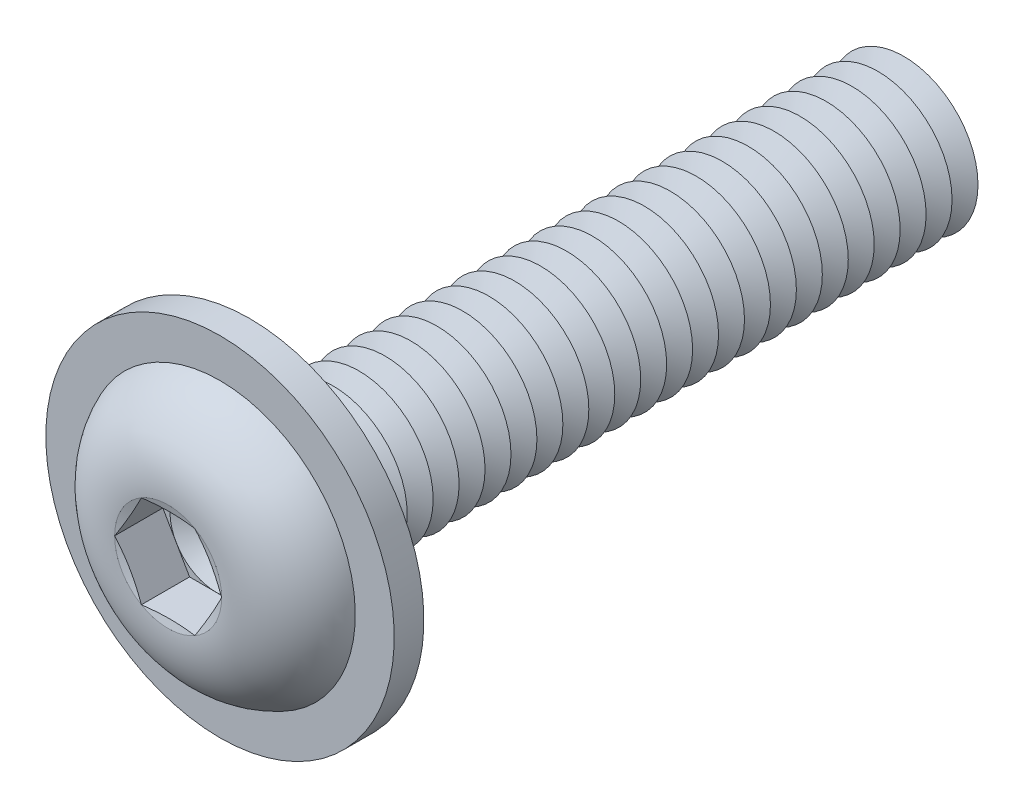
from build123d import *

# Parameters (mm, degrees)
FILLET1_R           = 0.35
LPATTERN1_COUNT     = 25
LPATTERN1_PITCH     = 0.7
CUT_EXTRUDE1_DEPTH  = 1.3
SKETCH5_R           = 4.7
SKETCH5_R_2         = 2.35
BOSS_EXTRUDE1_DEPTH = 0.8


with BuildPart() as part:
    # Sketch1 → Revolve1 (revolve)
    with BuildSketch(Plane(origin=(0, 0, 0), x_dir=(0, 0, -1), z_dir=(1, 0, 0)), mode=Mode.PRIVATE) as revolve1_sk:
        with BuildLine():
            Line((0, 2), (0, 3.8))
            ThreePointArc((0, 3.8), (-1.611961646, 3.099623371), (-2.2, 1.443375))
            Line((-2.2, 1.443375), (-2.006624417, 0.7216875))
            Line((-2.006624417, 0.7216875), (-2.2, 0.7216875))
            Line((-2.2, 0.7216875), (-2.2, 0))
            Line((-2.2, 0), (18, 0))
            Line((18, 0), (18, 2))
            Line((18, 2), (0, 2))
        make_face()
    revolve(revolve1_sk.sketch.rotate(Axis((0, 0, -18), (0, 0, 1)), 90), axis=Axis((0, 0, -18), (0, 0, 1)))

    # Fillet1
    fillet1_edges = [part.edges().sort_by_distance(p)[0] for p in [
        (2, 0, 0),
    ]]
    fillet(fillet1_edges, radius=FILLET1_R)

    # Sketch2 → Cut-Revolve1 (revolve, cut)
    with BuildSketch(Plane(origin=(0, 0, 0), x_dir=(0, 0, -1), z_dir=(1, 0, 0)), mode=Mode.PRIVATE) as cut_revolve1_sk:
        Polygon((17.65, 2), (18.35, 2), (18, 1.393782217), align=None)
    cut_revolve1 = revolve(cut_revolve1_sk.sketch.rotate(Axis((0, 0, -18), (0, 0, -1)), 270), axis=Axis((0, 0, -18), (0, 0, -1)), mode=Mode.SUBTRACT)

    # LPattern1: Cut-Revolve1 ×25
    with Locations(*[(0, 0, i * LPATTERN1_PITCH) for i in range(1, LPATTERN1_COUNT)]):
        add(cut_revolve1, mode=Mode.SUBTRACT)

    # Sketch3 → Cut-Extrude1 (cut)
    with BuildSketch(Plane.XY.offset(2.2)):
        Polygon((0.7216875, 1.249999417), (-0.7216875, 1.249999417), (-1.443375, 0), (-0.7216875, -1.249999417), (0.7216875, -1.249999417), (1.443375, 0), align=None)
    extrude(amount=-CUT_EXTRUDE1_DEPTH, mode=Mode.SUBTRACT)

    # Cut-Extrude2 cone 1 section (on through the dimple's axis) → Cut-Extrude2 (revolve, cut)
    with BuildSketch(Plane(origin=(0, 0, 0.9), x_dir=(0, -1, 0), z_dir=(1, 0, 0))):
        Polygon((0, 0), (1.249999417, 0), (0, 0.7216875), align=None)
    revolve(axis=Axis((0, 0, 0.9), (0, 0, -1)), mode=Mode.SUBTRACT)

    # Sketch5 → Boss-Extrude1 (add)
    with BuildSketch(Plane(origin=(0, 0, 0), x_dir=(-1, 0, 0), z_dir=(0, 0, -1))):
        with Locations(Location((0, 0, 0), (0, 0, 90))):
            Circle(SKETCH5_R)
        Circle(SKETCH5_R_2, mode=Mode.SUBTRACT)
    extrude(amount=-BOSS_EXTRUDE1_DEPTH)


solid = part.part
